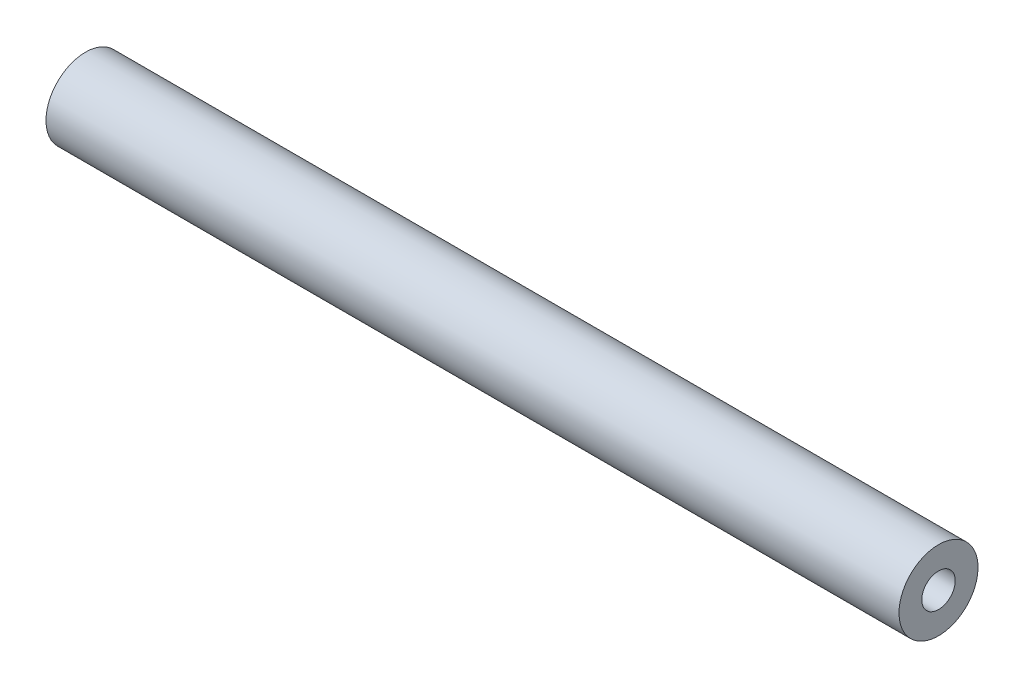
ISO-10303-21;
HEADER;
FILE_DESCRIPTION(('STEP AP214'),'2;1');
FILE_NAME('part.step','',(''),(''),'','','');
FILE_SCHEMA(('AUTOMOTIVE_DESIGN { 1 0 10303 214 1 1 1 1 }'));
ENDSEC;
DATA;
#1=APPLICATION_CONTEXT('core data for automotive mechanical design processes');
#2=APPLICATION_PROTOCOL_DEFINITION('international standard','automotive_design',2000,#1);
#3=PRODUCT_CONTEXT('',#1,'mechanical');
#4=PRODUCT('Part','Part','',(#3));
#5=PRODUCT_RELATED_PRODUCT_CATEGORY('part','',(#4));
#6=PRODUCT_DEFINITION_FORMATION('','',#4);
#7=PRODUCT_DEFINITION_CONTEXT('part definition',#1,'design');
#8=PRODUCT_DEFINITION('design','',#6,#7);
#9=PRODUCT_DEFINITION_SHAPE('','',#8);
#10=(LENGTH_UNIT() NAMED_UNIT(*) SI_UNIT(.MILLI.,.METRE.));
#11=(NAMED_UNIT(*) PLANE_ANGLE_UNIT() SI_UNIT($,.RADIAN.));
#12=(NAMED_UNIT(*) SI_UNIT($,.STERADIAN.) SOLID_ANGLE_UNIT());
#13=UNCERTAINTY_MEASURE_WITH_UNIT(LENGTH_MEASURE(1.E-05),#10,'distance_accuracy_value','');
#14=(GEOMETRIC_REPRESENTATION_CONTEXT(3) GLOBAL_UNCERTAINTY_ASSIGNED_CONTEXT((#13)) GLOBAL_UNIT_ASSIGNED_CONTEXT((#10,
#11,#12)) REPRESENTATION_CONTEXT('',''));
#15=CARTESIAN_POINT('',(0.,0.,0.));
#16=DIRECTION('',(0.,0.,1.));
#17=DIRECTION('',(1.,0.,0.));
#18=AXIS2_PLACEMENT_3D('',#15,#16,#17);
#19=CARTESIAN_POINT('',(144.851912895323,0.,0.));
#20=DIRECTION('',(1.,0.,0.));
#21=DIRECTION('',(0.,1.,0.));
#22=AXIS2_PLACEMENT_3D('',#19,#20,#21);
#23=CYLINDRICAL_SURFACE('',#22,3.17500000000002);
#24=CARTESIAN_POINT('',(15.24,0.,0.));
#25=DIRECTION('',(1.,0.,0.));
#26=DIRECTION('',(0.,1.,0.));
#27=AXIS2_PLACEMENT_3D('',#24,#25,#26);
#28=CIRCLE('',#27,3.17500000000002);
#29=CARTESIAN_POINT('',(15.24,3.175,0.));
#30=VERTEX_POINT('',#29);
#31=EDGE_CURVE('E52',#30,#30,#28,.T.);
#32=ORIENTED_EDGE('',*,*,#31,.T.);
#33=EDGE_LOOP('',(#32));
#34=FACE_BOUND('',#33,.T.);
#35=CARTESIAN_POINT('',(0.,0.,0.));
#36=DIRECTION('',(1.,0.,0.));
#37=DIRECTION('',(0.,1.,0.));
#38=AXIS2_PLACEMENT_3D('',#35,#36,#37);
#39=CIRCLE('',#38,3.17500000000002);
#40=CARTESIAN_POINT('',(0.,3.175,0.));
#41=VERTEX_POINT('',#40);
#42=EDGE_CURVE('E11',#41,#41,#39,.T.);
#43=ORIENTED_EDGE('',*,*,#42,.F.);
#44=EDGE_LOOP('',(#43));
#45=FACE_BOUND('',#44,.T.);
#46=ADVANCED_FACE('F32',(#34,#45),#23,.F.);
#47=CARTESIAN_POINT('',(0.,3.175,0.));
#48=DIRECTION('',(-1.,0.,0.));
#49=DIRECTION('',(0.,-1.,0.));
#50=AXIS2_PLACEMENT_3D('',#47,#48,#49);
#51=PLANE('',#50);
#52=ORIENTED_EDGE('',*,*,#42,.T.);
#53=EDGE_LOOP('',(#52));
#54=FACE_BOUND('',#53,.T.);
#55=CARTESIAN_POINT('',(0.,0.,0.));
#56=DIRECTION('',(1.,0.,0.));
#57=DIRECTION('',(0.,1.,0.));
#58=AXIS2_PLACEMENT_3D('',#55,#56,#57);
#59=CIRCLE('',#58,7.50000000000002);
#60=CARTESIAN_POINT('',(0.,7.5,0.));
#61=VERTEX_POINT('',#60);
#62=EDGE_CURVE('E39',#61,#61,#59,.T.);
#63=ORIENTED_EDGE('',*,*,#62,.F.);
#64=EDGE_LOOP('',(#63));
#65=FACE_BOUND('',#64,.T.);
#66=ADVANCED_FACE('F70',(#54,#65),#51,.T.);
#67=CARTESIAN_POINT('',(144.851912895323,0.,0.));
#68=DIRECTION('',(1.,0.,0.));
#69=DIRECTION('',(0.,1.,0.));
#70=AXIS2_PLACEMENT_3D('',#67,#68,#69);
#71=CYLINDRICAL_SURFACE('',#70,7.50000000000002);
#72=ORIENTED_EDGE('',*,*,#62,.T.);
#73=EDGE_LOOP('',(#72));
#74=FACE_BOUND('',#73,.T.);
#75=CARTESIAN_POINT('',(161.925,0.,0.));
#76=DIRECTION('',(1.,0.,0.));
#77=DIRECTION('',(0.,1.,0.));
#78=AXIS2_PLACEMENT_3D('',#75,#76,#77);
#79=CIRCLE('',#78,7.50000000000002);
#80=CARTESIAN_POINT('',(161.925,7.50000000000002,0.));
#81=VERTEX_POINT('',#80);
#82=EDGE_CURVE('E62',#81,#81,#79,.T.);
#83=ORIENTED_EDGE('',*,*,#82,.F.);
#84=EDGE_LOOP('',(#83));
#85=FACE_BOUND('',#84,.T.);
#86=ADVANCED_FACE('F67',(#74,#85),#71,.T.);
#87=CARTESIAN_POINT('',(161.925,7.50000000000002,0.));
#88=DIRECTION('',(1.,0.,0.));
#89=DIRECTION('',(0.,1.,0.));
#90=AXIS2_PLACEMENT_3D('',#87,#88,#89);
#91=PLANE('',#90);
#92=ORIENTED_EDGE('',*,*,#82,.T.);
#93=EDGE_LOOP('',(#92));
#94=FACE_BOUND('',#93,.T.);
#95=CARTESIAN_POINT('',(161.925,0.,0.));
#96=DIRECTION('',(1.,0.,0.));
#97=DIRECTION('',(0.,1.,0.));
#98=AXIS2_PLACEMENT_3D('',#95,#96,#97);
#99=CIRCLE('',#98,3.17500000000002);
#100=CARTESIAN_POINT('',(161.925,3.17500000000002,0.));
#101=VERTEX_POINT('',#100);
#102=EDGE_CURVE('E57',#101,#101,#99,.T.);
#103=ORIENTED_EDGE('',*,*,#102,.F.);
#104=EDGE_LOOP('',(#103));
#105=FACE_BOUND('',#104,.T.);
#106=ADVANCED_FACE('F77',(#94,#105),#91,.T.);
#107=CARTESIAN_POINT('',(144.851912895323,0.,0.));
#108=DIRECTION('',(1.,0.,0.));
#109=DIRECTION('',(0.,1.,0.));
#110=AXIS2_PLACEMENT_3D('',#107,#108,#109);
#111=CYLINDRICAL_SURFACE('',#110,3.17500000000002);
#112=ORIENTED_EDGE('',*,*,#102,.T.);
#113=EDGE_LOOP('',(#112));
#114=FACE_BOUND('',#113,.T.);
#115=CARTESIAN_POINT('',(146.685,0.,0.));
#116=DIRECTION('',(1.,0.,0.));
#117=DIRECTION('',(0.,1.,0.));
#118=AXIS2_PLACEMENT_3D('',#115,#116,#117);
#119=CIRCLE('',#118,3.17500000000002);
#120=CARTESIAN_POINT('',(146.685,3.17500000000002,0.));
#121=VERTEX_POINT('',#120);
#122=EDGE_CURVE('E54',#121,#121,#119,.T.);
#123=ORIENTED_EDGE('',*,*,#122,.F.);
#124=EDGE_LOOP('',(#123));
#125=FACE_BOUND('',#124,.T.);
#126=ADVANCED_FACE('F82',(#114,#125),#111,.F.);
#127=CARTESIAN_POINT('',(144.851912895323,0.,0.));
#128=DIRECTION('',(1.,0.,0.));
#129=DIRECTION('',(0.,1.,0.));
#130=AXIS2_PLACEMENT_3D('',#127,#128,#129);
#131=CONICAL_SURFACE('',#130,0.,1.0471975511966);
#132=ORIENTED_EDGE('',*,*,#122,.T.);
#133=EDGE_LOOP('',(#132));
#134=FACE_BOUND('',#133,.T.);
#135=CARTESIAN_POINT('',(144.851912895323,0.,0.));
#136=VERTEX_POINT('',#135);
#137=VERTEX_LOOP('',#136);
#138=FACE_BOUND('',#137,.T.);
#139=ADVANCED_FACE('F48',(#134,#138),#131,.F.);
#140=CARTESIAN_POINT('',(15.24,0.,0.));
#141=DIRECTION('',(-1.,0.,0.));
#142=DIRECTION('',(0.,-1.,0.));
#143=AXIS2_PLACEMENT_3D('',#140,#141,#142);
#144=CONICAL_SURFACE('',#143,3.17500000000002,1.0471975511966);
#145=CARTESIAN_POINT('',(17.0730871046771,0.,0.));
#146=VERTEX_POINT('',#145);
#147=VERTEX_LOOP('',#146);
#148=FACE_BOUND('',#147,.T.);
#149=ORIENTED_EDGE('',*,*,#31,.F.);
#150=EDGE_LOOP('',(#149));
#151=FACE_BOUND('',#150,.T.);
#152=ADVANCED_FACE('F45',(#148,#151),#144,.F.);
#153=CLOSED_SHELL('',(#46,#66,#86,#106,#126,#139,#152));
#154=MANIFOLD_SOLID_BREP('B2',#153);
#155=ADVANCED_BREP_SHAPE_REPRESENTATION('',(#18,#154),#14);
#156=SHAPE_DEFINITION_REPRESENTATION(#9,#155);
ENDSEC;
END-ISO-10303-21;
